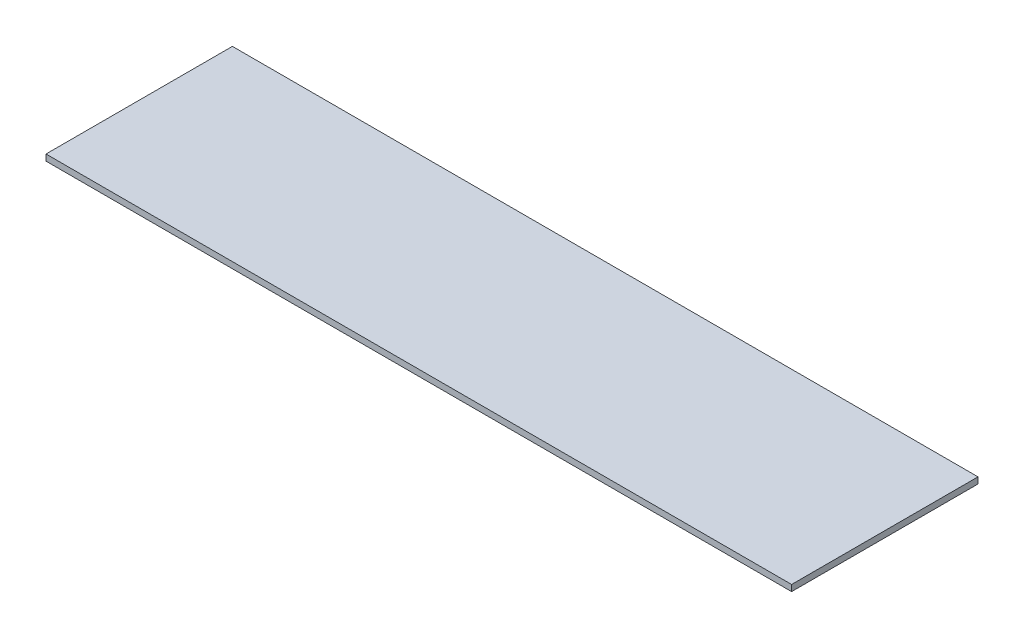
from build123d import *

# Parameters (mm, degrees)
ESQUISSE2_W        = 120
ESQUISSE2_H        = 30
BOSS_EXTRU_1_DEPTH = 1


with BuildPart() as part:
    # Esquisse2 → Boss.-Extru.1 (new body)
    with BuildSketch(Plane(origin=(0, 0, 0), x_dir=(1, 0, 0), z_dir=(0, 1, 0))):
        Rectangle(ESQUISSE2_W, ESQUISSE2_H)
    extrude(amount=BOSS_EXTRU_1_DEPTH)


solid = part.part
